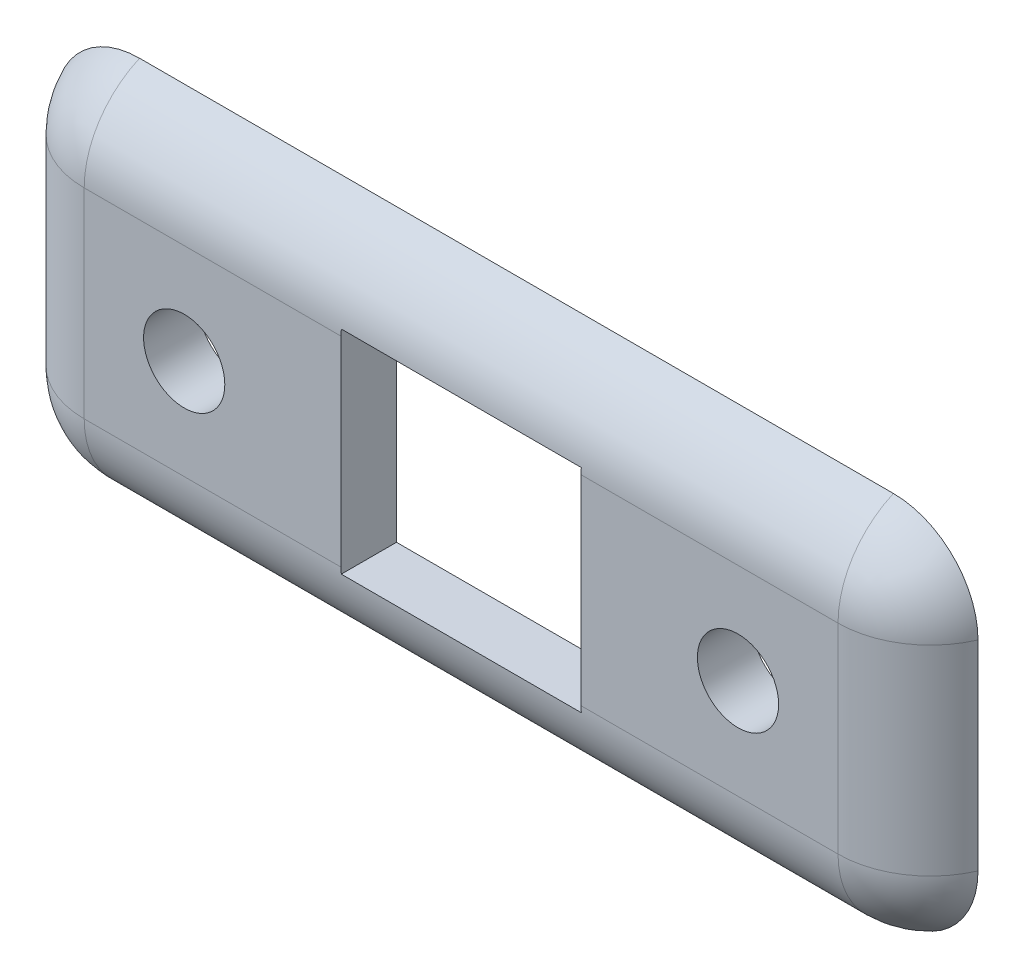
ISO-10303-21;
HEADER;
FILE_DESCRIPTION(('STEP AP214'),'2;1');
FILE_NAME('part.step','',(''),(''),'','','');
FILE_SCHEMA(('AUTOMOTIVE_DESIGN { 1 0 10303 214 1 1 1 1 }'));
ENDSEC;
DATA;
#1=APPLICATION_CONTEXT('core data for automotive mechanical design processes');
#2=APPLICATION_PROTOCOL_DEFINITION('international standard','automotive_design',2000,#1);
#3=PRODUCT_CONTEXT('',#1,'mechanical');
#4=PRODUCT('Part','Part','',(#3));
#5=PRODUCT_RELATED_PRODUCT_CATEGORY('part','',(#4));
#6=PRODUCT_DEFINITION_FORMATION('','',#4);
#7=PRODUCT_DEFINITION_CONTEXT('part definition',#1,'design');
#8=PRODUCT_DEFINITION('design','',#6,#7);
#9=PRODUCT_DEFINITION_SHAPE('','',#8);
#10=(LENGTH_UNIT() NAMED_UNIT(*) SI_UNIT(.MILLI.,.METRE.));
#11=(NAMED_UNIT(*) PLANE_ANGLE_UNIT() SI_UNIT($,.RADIAN.));
#12=(NAMED_UNIT(*) SI_UNIT($,.STERADIAN.) SOLID_ANGLE_UNIT());
#13=UNCERTAINTY_MEASURE_WITH_UNIT(LENGTH_MEASURE(1.E-05),#10,'distance_accuracy_value','');
#14=(GEOMETRIC_REPRESENTATION_CONTEXT(3) GLOBAL_UNCERTAINTY_ASSIGNED_CONTEXT((#13)) GLOBAL_UNIT_ASSIGNED_CONTEXT((#10,
#11,#12)) REPRESENTATION_CONTEXT('',''));
#15=CARTESIAN_POINT('',(0.,0.,0.));
#16=DIRECTION('',(0.,0.,1.));
#17=DIRECTION('',(1.,0.,0.));
#18=AXIS2_PLACEMENT_3D('',#15,#16,#17);
#19=CARTESIAN_POINT('',(0.,0.,3.));
#20=DIRECTION('',(0.,0.,1.));
#21=DIRECTION('',(1.,0.,0.));
#22=AXIS2_PLACEMENT_3D('',#19,#20,#21);
#23=PLANE('',#22);
#24=CARTESIAN_POINT('',(14.0422053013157,5.9351145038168,3.));
#25=DIRECTION('',(0.,0.,1.));
#26=DIRECTION('',(1.,0.,0.));
#27=AXIS2_PLACEMENT_3D('',#24,#25,#26);
#28=CIRCLE('',#27,2.2);
#29=CARTESIAN_POINT('',(16.2422053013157,5.9351145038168,3.));
#30=VERTEX_POINT('',#29);
#31=EDGE_CURVE('E153',#30,#30,#28,.T.);
#32=ORIENTED_EDGE('',*,*,#31,.F.);
#33=EDGE_LOOP('',(#32));
#34=FACE_BOUND('',#33,.T.);
#35=DIRECTION('',(0.,1.,0.));
#36=VECTOR('',#35,1.);
#37=CARTESIAN_POINT('',(5.5422053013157,11.6851145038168,3.));
#38=LINE('',#37,#36);
#39=CARTESIAN_POINT('',(5.5422053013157,0.517690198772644,3.));
#40=VERTEX_POINT('',#39);
#41=CARTESIAN_POINT('',(5.54220530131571,11.352538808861,3.));
#42=VERTEX_POINT('',#41);
#43=EDGE_CURVE('E147',#40,#42,#38,.T.);
#44=ORIENTED_EDGE('',*,*,#43,.F.);
#45=DIRECTION('',(-1.,0.,0.));
#46=VECTOR('',#45,1.);
#47=CARTESIAN_POINT('',(24.0422053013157,0.517690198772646,3.));
#48=LINE('',#47,#46);
#49=CARTESIAN_POINT('',(19.4596296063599,0.517690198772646,3.));
#50=VERTEX_POINT('',#49);
#51=EDGE_CURVE('E191',#40,#50,#48,.F.);
#52=ORIENTED_EDGE('',*,*,#51,.T.);
#53=DIRECTION('',(0.,-1.,0.));
#54=VECTOR('',#53,1.);
#55=CARTESIAN_POINT('',(19.4596296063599,15.9351145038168,3.));
#56=LINE('',#55,#54);
#57=CARTESIAN_POINT('',(19.4596296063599,11.352538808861,3.));
#58=VERTEX_POINT('',#57);
#59=EDGE_CURVE('E188',#50,#58,#56,.F.);
#60=ORIENTED_EDGE('',*,*,#59,.T.);
#61=DIRECTION('',(1.,0.,0.));
#62=VECTOR('',#61,1.);
#63=CARTESIAN_POINT('',(-25.9577946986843,11.352538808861,3.));
#64=LINE('',#63,#62);
#65=EDGE_CURVE('E186',#58,#42,#64,.F.);
#66=ORIENTED_EDGE('',*,*,#65,.T.);
#67=EDGE_LOOP('',(#44,#52,#60,#66));
#68=FACE_BOUND('',#67,.T.);
#69=ADVANCED_FACE('F33',(#34,#68),#23,.T.);
#70=CARTESIAN_POINT('',(-15.9577946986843,5.9351145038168,3.));
#71=DIRECTION('',(0.,0.,1.));
#72=DIRECTION('',(1.,0.,0.));
#73=AXIS2_PLACEMENT_3D('',#70,#71,#72);
#74=CIRCLE('',#73,2.2);
#75=CARTESIAN_POINT('',(-13.7577946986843,5.9351145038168,3.));
#76=VERTEX_POINT('',#75);
#77=EDGE_CURVE('E413',#76,#76,#74,.T.);
#78=ORIENTED_EDGE('',*,*,#77,.F.);
#79=EDGE_LOOP('',(#78));
#80=FACE_BOUND('',#79,.T.);
#81=DIRECTION('',(0.,1.,0.));
#82=VECTOR('',#81,1.);
#83=CARTESIAN_POINT('',(-21.3752190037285,-4.0648854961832,3.));
#84=LINE('',#83,#82);
#85=CARTESIAN_POINT('',(-21.3752190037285,11.352538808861,3.));
#86=VERTEX_POINT('',#85);
#87=CARTESIAN_POINT('',(-21.3752190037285,0.517690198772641,3.));
#88=VERTEX_POINT('',#87);
#89=EDGE_CURVE('E177',#86,#88,#84,.F.);
#90=ORIENTED_EDGE('',*,*,#89,.T.);
#91=DIRECTION('',(-1.,0.,0.));
#92=VECTOR('',#91,1.);
#93=CARTESIAN_POINT('',(24.0422053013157,0.517690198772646,3.));
#94=LINE('',#93,#92);
#95=CARTESIAN_POINT('',(-7.45779469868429,0.517690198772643,3.));
#96=VERTEX_POINT('',#95);
#97=EDGE_CURVE('E183',#88,#96,#94,.F.);
#98=ORIENTED_EDGE('',*,*,#97,.T.);
#99=DIRECTION('',(0.,-1.,0.));
#100=VECTOR('',#99,1.);
#101=CARTESIAN_POINT('',(-7.45779469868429,11.6851145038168,3.));
#102=LINE('',#101,#100);
#103=CARTESIAN_POINT('',(-7.45779469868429,11.352538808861,3.));
#104=VERTEX_POINT('',#103);
#105=EDGE_CURVE('E150',#104,#96,#102,.T.);
#106=ORIENTED_EDGE('',*,*,#105,.F.);
#107=DIRECTION('',(1.,0.,0.));
#108=VECTOR('',#107,1.);
#109=CARTESIAN_POINT('',(-25.9577946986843,11.352538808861,3.));
#110=LINE('',#109,#108);
#111=EDGE_CURVE('E180',#104,#86,#110,.F.);
#112=ORIENTED_EDGE('',*,*,#111,.T.);
#113=EDGE_LOOP('',(#90,#98,#106,#112));
#114=FACE_BOUND('',#113,.T.);
#115=ADVANCED_FACE('F234',(#80,#114),#23,.T.);
#116=CARTESIAN_POINT('',(0.,0.,0.));
#117=DIRECTION('',(0.,0.,1.));
#118=DIRECTION('',(1.,0.,0.));
#119=AXIS2_PLACEMENT_3D('',#116,#117,#118);
#120=PLANE('',#119);
#121=CARTESIAN_POINT('',(-15.9577946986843,5.9351145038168,0.));
#122=DIRECTION('',(0.,0.,1.));
#123=DIRECTION('',(1.,0.,0.));
#124=AXIS2_PLACEMENT_3D('',#121,#122,#123);
#125=CIRCLE('',#124,2.2);
#126=CARTESIAN_POINT('',(-13.7577946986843,5.9351145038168,0.));
#127=VERTEX_POINT('',#126);
#128=EDGE_CURVE('E158',#127,#127,#125,.T.);
#129=ORIENTED_EDGE('',*,*,#128,.T.);
#130=EDGE_LOOP('',(#129));
#131=FACE_BOUND('',#130,.T.);
#132=CARTESIAN_POINT('',(14.0422053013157,5.9351145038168,0.));
#133=DIRECTION('',(0.,0.,1.));
#134=DIRECTION('',(1.,0.,0.));
#135=AXIS2_PLACEMENT_3D('',#132,#133,#134);
#136=CIRCLE('',#135,2.2);
#137=CARTESIAN_POINT('',(16.2422053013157,5.9351145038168,0.));
#138=VERTEX_POINT('',#137);
#139=EDGE_CURVE('E411',#138,#138,#136,.T.);
#140=ORIENTED_EDGE('',*,*,#139,.T.);
#141=EDGE_LOOP('',(#140));
#142=FACE_BOUND('',#141,.T.);
#143=DIRECTION('',(-1.,0.,0.));
#144=VECTOR('',#143,1.);
#145=CARTESIAN_POINT('',(-7.45779469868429,11.6851145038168,0.));
#146=LINE('',#145,#144);
#147=CARTESIAN_POINT('',(5.5422053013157,11.6851145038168,0.));
#148=VERTEX_POINT('',#147);
#149=CARTESIAN_POINT('',(-7.45779469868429,11.6851145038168,0.));
#150=VERTEX_POINT('',#149);
#151=EDGE_CURVE('E134',#148,#150,#146,.T.);
#152=ORIENTED_EDGE('',*,*,#151,.T.);
#153=DIRECTION('',(0.,-1.,0.));
#154=VECTOR('',#153,1.);
#155=CARTESIAN_POINT('',(-7.45779469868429,11.6851145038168,0.));
#156=LINE('',#155,#154);
#157=CARTESIAN_POINT('',(-7.45779469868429,0.185114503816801,0.));
#158=VERTEX_POINT('',#157);
#159=EDGE_CURVE('E128',#150,#158,#156,.T.);
#160=ORIENTED_EDGE('',*,*,#159,.T.);
#161=DIRECTION('',(1.,0.,0.));
#162=VECTOR('',#161,1.);
#163=CARTESIAN_POINT('',(-7.45779469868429,0.185114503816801,0.));
#164=LINE('',#163,#162);
#165=CARTESIAN_POINT('',(5.5422053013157,0.185114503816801,0.));
#166=VERTEX_POINT('',#165);
#167=EDGE_CURVE('E138',#158,#166,#164,.T.);
#168=ORIENTED_EDGE('',*,*,#167,.T.);
#169=DIRECTION('',(0.,1.,0.));
#170=VECTOR('',#169,1.);
#171=CARTESIAN_POINT('',(5.5422053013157,11.6851145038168,0.));
#172=LINE('',#171,#170);
#173=EDGE_CURVE('E143',#166,#148,#172,.T.);
#174=ORIENTED_EDGE('',*,*,#173,.T.);
#175=EDGE_LOOP('',(#152,#160,#168,#174));
#176=FACE_BOUND('',#175,.T.);
#177=DIRECTION('',(0.,1.,0.));
#178=VECTOR('',#177,1.);
#179=CARTESIAN_POINT('',(24.0422053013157,-4.06488549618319,0.));
#180=LINE('',#179,#178);
#181=CARTESIAN_POINT('',(24.0422053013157,0.517690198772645,0.));
#182=VERTEX_POINT('',#181);
#183=CARTESIAN_POINT('',(24.0422053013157,11.352538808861,0.));
#184=VERTEX_POINT('',#183);
#185=EDGE_CURVE('E162',#182,#184,#180,.T.);
#186=ORIENTED_EDGE('',*,*,#185,.F.);
#187=CARTESIAN_POINT('',(19.4596296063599,0.517690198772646,0.));
#188=DIRECTION('',(0.,0.,1.));
#189=DIRECTION('',(1.,0.,0.));
#190=AXIS2_PLACEMENT_3D('',#187,#188,#189);
#191=CIRCLE('',#190,4.58257569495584);
#192=CARTESIAN_POINT('',(19.4596296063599,-4.0648854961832,0.));
#193=VERTEX_POINT('',#192);
#194=EDGE_CURVE('E221',#182,#193,#191,.F.);
#195=ORIENTED_EDGE('',*,*,#194,.T.);
#196=DIRECTION('',(1.,0.,0.));
#197=VECTOR('',#196,1.);
#198=CARTESIAN_POINT('',(24.0422053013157,-4.06488549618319,0.));
#199=LINE('',#198,#197);
#200=CARTESIAN_POINT('',(-21.3752190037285,-4.0648854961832,0.));
#201=VERTEX_POINT('',#200);
#202=EDGE_CURVE('E174',#201,#193,#199,.T.);
#203=ORIENTED_EDGE('',*,*,#202,.F.);
#204=CARTESIAN_POINT('',(-21.3752190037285,0.517690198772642,0.));
#205=DIRECTION('',(0.,0.,1.));
#206=DIRECTION('',(1.,0.,0.));
#207=AXIS2_PLACEMENT_3D('',#204,#205,#206);
#208=CIRCLE('',#207,4.58257569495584);
#209=CARTESIAN_POINT('',(-25.9577946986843,0.517690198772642,0.));
#210=VERTEX_POINT('',#209);
#211=EDGE_CURVE('E216',#201,#210,#208,.F.);
#212=ORIENTED_EDGE('',*,*,#211,.T.);
#213=DIRECTION('',(0.,-1.,0.));
#214=VECTOR('',#213,1.);
#215=CARTESIAN_POINT('',(-25.9577946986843,-4.0648854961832,0.));
#216=LINE('',#215,#214);
#217=CARTESIAN_POINT('',(-25.9577946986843,11.352538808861,0.));
#218=VERTEX_POINT('',#217);
#219=EDGE_CURVE('E171',#218,#210,#216,.T.);
#220=ORIENTED_EDGE('',*,*,#219,.F.);
#221=CARTESIAN_POINT('',(-21.3752190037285,11.352538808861,0.));
#222=DIRECTION('',(0.,0.,1.));
#223=DIRECTION('',(1.,0.,0.));
#224=AXIS2_PLACEMENT_3D('',#221,#222,#223);
#225=CIRCLE('',#224,4.58257569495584);
#226=CARTESIAN_POINT('',(-21.3752190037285,15.9351145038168,0.));
#227=VERTEX_POINT('',#226);
#228=EDGE_CURVE('E48',#218,#227,#225,.F.);
#229=ORIENTED_EDGE('',*,*,#228,.T.);
#230=DIRECTION('',(-1.,0.,0.));
#231=VECTOR('',#230,1.);
#232=CARTESIAN_POINT('',(24.0422053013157,15.9351145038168,0.));
#233=LINE('',#232,#231);
#234=CARTESIAN_POINT('',(19.4596296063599,15.9351145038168,0.));
#235=VERTEX_POINT('',#234);
#236=EDGE_CURVE('E169',#235,#227,#233,.T.);
#237=ORIENTED_EDGE('',*,*,#236,.F.);
#238=CARTESIAN_POINT('',(19.4596296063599,11.352538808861,0.));
#239=DIRECTION('',(0.,0.,1.));
#240=DIRECTION('',(1.,0.,0.));
#241=AXIS2_PLACEMENT_3D('',#238,#239,#240);
#242=CIRCLE('',#241,4.58257569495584);
#243=EDGE_CURVE('E219',#235,#184,#242,.F.);
#244=ORIENTED_EDGE('',*,*,#243,.T.);
#245=EDGE_LOOP('',(#186,#195,#203,#212,#220,#229,#237,#244));
#246=FACE_BOUND('',#245,.T.);
#247=ADVANCED_FACE('F145',(#131,#142,#176,#246),#120,.F.);
#248=CARTESIAN_POINT('',(-7.45779469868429,11.6851145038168,0.));
#249=DIRECTION('',(-1.,0.,0.));
#250=DIRECTION('',(0.,0.,1.));
#251=AXIS2_PLACEMENT_3D('',#248,#249,#250);
#252=PLANE('',#251);
#253=ORIENTED_EDGE('',*,*,#105,.T.);
#254=CARTESIAN_POINT('',(-7.45779469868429,0.517690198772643,-2.));
#255=DIRECTION('',(-1.,0.,0.));
#256=DIRECTION('',(0.,0.,1.));
#257=AXIS2_PLACEMENT_3D('',#254,#255,#256);
#258=CIRCLE('',#257,5.);
#259=CARTESIAN_POINT('',(-7.45779469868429,0.185114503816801,2.98892707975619));
#260=VERTEX_POINT('',#259);
#261=EDGE_CURVE('E130',#96,#260,#258,.F.);
#262=ORIENTED_EDGE('',*,*,#261,.T.);
#263=DIRECTION('',(0.,0.,1.));
#264=VECTOR('',#263,1.);
#265=CARTESIAN_POINT('',(-7.45779469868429,0.185114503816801,0.));
#266=LINE('',#265,#264);
#267=EDGE_CURVE('E122',#158,#260,#266,.T.);
#268=ORIENTED_EDGE('',*,*,#267,.F.);
#269=ORIENTED_EDGE('',*,*,#159,.F.);
#270=DIRECTION('',(0.,0.,1.));
#271=VECTOR('',#270,1.);
#272=CARTESIAN_POINT('',(-7.45779469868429,11.6851145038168,0.));
#273=LINE('',#272,#271);
#274=CARTESIAN_POINT('',(-7.45779469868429,11.6851145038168,2.98892707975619));
#275=VERTEX_POINT('',#274);
#276=EDGE_CURVE('E160',#150,#275,#273,.T.);
#277=ORIENTED_EDGE('',*,*,#276,.T.);
#278=CARTESIAN_POINT('',(-7.45779469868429,11.352538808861,-2.));
#279=DIRECTION('',(-1.,0.,0.));
#280=DIRECTION('',(0.,0.,1.));
#281=AXIS2_PLACEMENT_3D('',#278,#279,#280);
#282=CIRCLE('',#281,5.);
#283=EDGE_CURVE('E194',#275,#104,#282,.F.);
#284=ORIENTED_EDGE('',*,*,#283,.T.);
#285=EDGE_LOOP('',(#253,#262,#268,#269,#277,#284));
#286=FACE_BOUND('',#285,.T.);
#287=ADVANCED_FACE('F125',(#286),#252,.F.);
#288=CARTESIAN_POINT('',(-7.45779469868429,11.6851145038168,0.));
#289=DIRECTION('',(0.,1.,0.));
#290=DIRECTION('',(0.,0.,1.));
#291=AXIS2_PLACEMENT_3D('',#288,#289,#290);
#292=PLANE('',#291);
#293=DIRECTION('',(0.,0.,1.));
#294=VECTOR('',#293,1.);
#295=CARTESIAN_POINT('',(5.5422053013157,11.6851145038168,0.));
#296=LINE('',#295,#294);
#297=CARTESIAN_POINT('',(5.5422053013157,11.6851145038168,2.98892707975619));
#298=VERTEX_POINT('',#297);
#299=EDGE_CURVE('E163',#148,#298,#296,.T.);
#300=ORIENTED_EDGE('',*,*,#299,.T.);
#301=DIRECTION('',(-1.,0.,0.));
#302=VECTOR('',#301,1.);
#303=CARTESIAN_POINT('',(5.5422053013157,11.6851145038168,2.98892707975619));
#304=LINE('',#303,#302);
#305=EDGE_CURVE('E203',#298,#275,#304,.T.);
#306=ORIENTED_EDGE('',*,*,#305,.T.);
#307=ORIENTED_EDGE('',*,*,#276,.F.);
#308=ORIENTED_EDGE('',*,*,#151,.F.);
#309=EDGE_LOOP('',(#300,#306,#307,#308));
#310=FACE_BOUND('',#309,.T.);
#311=ADVANCED_FACE('F262',(#310),#292,.F.);
#312=CARTESIAN_POINT('',(5.5422053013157,11.6851145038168,0.));
#313=DIRECTION('',(1.,0.,0.));
#314=DIRECTION('',(0.,0.,-1.));
#315=AXIS2_PLACEMENT_3D('',#312,#313,#314);
#316=PLANE('',#315);
#317=DIRECTION('',(0.,0.,1.));
#318=VECTOR('',#317,1.);
#319=CARTESIAN_POINT('',(5.5422053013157,0.185114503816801,0.));
#320=LINE('',#319,#318);
#321=CARTESIAN_POINT('',(5.54220530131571,0.185114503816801,2.98892707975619));
#322=VERTEX_POINT('',#321);
#323=EDGE_CURVE('E133',#166,#322,#320,.T.);
#324=ORIENTED_EDGE('',*,*,#323,.T.);
#325=CARTESIAN_POINT('',(5.54220530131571,0.517690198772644,-2.));
#326=DIRECTION('',(1.,0.,0.));
#327=DIRECTION('',(0.,0.,-1.));
#328=AXIS2_PLACEMENT_3D('',#325,#326,#327);
#329=CIRCLE('',#328,5.);
#330=EDGE_CURVE('E201',#322,#40,#329,.F.);
#331=ORIENTED_EDGE('',*,*,#330,.T.);
#332=ORIENTED_EDGE('',*,*,#43,.T.);
#333=CARTESIAN_POINT('',(5.54220530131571,11.352538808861,-2.));
#334=DIRECTION('',(1.,0.,0.));
#335=DIRECTION('',(0.,0.,-1.));
#336=AXIS2_PLACEMENT_3D('',#333,#334,#335);
#337=CIRCLE('',#336,5.);
#338=EDGE_CURVE('E199',#42,#298,#337,.F.);
#339=ORIENTED_EDGE('',*,*,#338,.T.);
#340=ORIENTED_EDGE('',*,*,#299,.F.);
#341=ORIENTED_EDGE('',*,*,#173,.F.);
#342=EDGE_LOOP('',(#324,#331,#332,#339,#340,#341));
#343=FACE_BOUND('',#342,.T.);
#344=ADVANCED_FACE('F260',(#343),#316,.F.);
#345=CARTESIAN_POINT('',(-7.45779469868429,0.185114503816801,0.));
#346=DIRECTION('',(0.,-1.,0.));
#347=DIRECTION('',(0.,0.,-1.));
#348=AXIS2_PLACEMENT_3D('',#345,#346,#347);
#349=PLANE('',#348);
#350=ORIENTED_EDGE('',*,*,#267,.T.);
#351=DIRECTION('',(1.,0.,0.));
#352=VECTOR('',#351,1.);
#353=CARTESIAN_POINT('',(-7.45779469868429,0.185114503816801,2.98892707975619));
#354=LINE('',#353,#352);
#355=EDGE_CURVE('E197',#260,#322,#354,.T.);
#356=ORIENTED_EDGE('',*,*,#355,.T.);
#357=ORIENTED_EDGE('',*,*,#323,.F.);
#358=ORIENTED_EDGE('',*,*,#167,.F.);
#359=EDGE_LOOP('',(#350,#356,#357,#358));
#360=FACE_BOUND('',#359,.T.);
#361=ADVANCED_FACE('F139',(#360),#349,.F.);
#362=CARTESIAN_POINT('',(14.0422053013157,5.9351145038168,0.));
#363=DIRECTION('',(0.,0.,1.));
#364=DIRECTION('',(1.,0.,0.));
#365=AXIS2_PLACEMENT_3D('',#362,#363,#364);
#366=CYLINDRICAL_SURFACE('',#365,2.2);
#367=ORIENTED_EDGE('',*,*,#139,.F.);
#368=EDGE_LOOP('',(#367));
#369=FACE_BOUND('',#368,.T.);
#370=ORIENTED_EDGE('',*,*,#31,.T.);
#371=EDGE_LOOP('',(#370));
#372=FACE_BOUND('',#371,.T.);
#373=ADVANCED_FACE('F353',(#369,#372),#366,.F.);
#374=CARTESIAN_POINT('',(-15.9577946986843,5.9351145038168,0.));
#375=DIRECTION('',(0.,0.,1.));
#376=DIRECTION('',(1.,0.,0.));
#377=AXIS2_PLACEMENT_3D('',#374,#375,#376);
#378=CYLINDRICAL_SURFACE('',#377,2.2);
#379=ORIENTED_EDGE('',*,*,#128,.F.);
#380=EDGE_LOOP('',(#379));
#381=FACE_BOUND('',#380,.T.);
#382=ORIENTED_EDGE('',*,*,#77,.T.);
#383=EDGE_LOOP('',(#382));
#384=FACE_BOUND('',#383,.T.);
#385=ADVANCED_FACE('F295',(#381,#384),#378,.F.);
#386=CARTESIAN_POINT('',(24.0422053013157,11.352538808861,-2.));
#387=DIRECTION('',(-1.,0.,0.));
#388=DIRECTION('',(0.,0.,1.));
#389=AXIS2_PLACEMENT_3D('',#386,#387,#388);
#390=CYLINDRICAL_SURFACE('',#389,5.);
#391=ORIENTED_EDGE('',*,*,#65,.F.);
#392=CARTESIAN_POINT('',(19.4596296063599,11.352538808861,-2.));
#393=DIRECTION('',(-1.,0.,0.));
#394=DIRECTION('',(0.,0.,1.));
#395=AXIS2_PLACEMENT_3D('',#392,#393,#394);
#396=CIRCLE('',#395,5.);
#397=EDGE_CURVE('E55',#58,#235,#396,.T.);
#398=ORIENTED_EDGE('',*,*,#397,.T.);
#399=ORIENTED_EDGE('',*,*,#236,.T.);
#400=CARTESIAN_POINT('',(-21.3752190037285,11.352538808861,-2.));
#401=DIRECTION('',(-1.,0.,0.));
#402=DIRECTION('',(0.,0.,1.));
#403=AXIS2_PLACEMENT_3D('',#400,#401,#402);
#404=CIRCLE('',#403,5.);
#405=EDGE_CURVE('E223',#227,#86,#404,.F.);
#406=ORIENTED_EDGE('',*,*,#405,.T.);
#407=ORIENTED_EDGE('',*,*,#111,.F.);
#408=ORIENTED_EDGE('',*,*,#283,.F.);
#409=ORIENTED_EDGE('',*,*,#305,.F.);
#410=ORIENTED_EDGE('',*,*,#338,.F.);
#411=EDGE_LOOP('',(#391,#398,#399,#406,#407,#408,#409,#410));
#412=FACE_BOUND('',#411,.T.);
#413=ADVANCED_FACE('F256',(#412),#390,.T.);
#414=CARTESIAN_POINT('',(-21.3752190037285,-4.0648854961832,-2.));
#415=DIRECTION('',(0.,-1.,0.));
#416=DIRECTION('',(0.,0.,-1.));
#417=AXIS2_PLACEMENT_3D('',#414,#415,#416);
#418=CYLINDRICAL_SURFACE('',#417,5.);
#419=ORIENTED_EDGE('',*,*,#89,.F.);
#420=CARTESIAN_POINT('',(-21.3752190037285,11.352538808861,-2.));
#421=DIRECTION('',(0.,-1.,0.));
#422=DIRECTION('',(0.,0.,-1.));
#423=AXIS2_PLACEMENT_3D('',#420,#421,#422);
#424=CIRCLE('',#423,5.);
#425=EDGE_CURVE('E11',#86,#218,#424,.T.);
#426=ORIENTED_EDGE('',*,*,#425,.T.);
#427=ORIENTED_EDGE('',*,*,#219,.T.);
#428=CARTESIAN_POINT('',(-21.3752190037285,0.517690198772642,-2.));
#429=DIRECTION('',(0.,-1.,0.));
#430=DIRECTION('',(0.,0.,-1.));
#431=AXIS2_PLACEMENT_3D('',#428,#429,#430);
#432=CIRCLE('',#431,5.);
#433=EDGE_CURVE('E41',#210,#88,#432,.F.);
#434=ORIENTED_EDGE('',*,*,#433,.T.);
#435=EDGE_LOOP('',(#419,#426,#427,#434));
#436=FACE_BOUND('',#435,.T.);
#437=ADVANCED_FACE('F228',(#436),#418,.T.);
#438=CARTESIAN_POINT('',(19.4596296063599,-4.06488549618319,-2.));
#439=DIRECTION('',(0.,1.,0.));
#440=DIRECTION('',(0.,0.,1.));
#441=AXIS2_PLACEMENT_3D('',#438,#439,#440);
#442=CYLINDRICAL_SURFACE('',#441,5.);
#443=ORIENTED_EDGE('',*,*,#59,.F.);
#444=CARTESIAN_POINT('',(19.4596296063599,0.517690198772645,-2.));
#445=DIRECTION('',(0.,1.,0.));
#446=DIRECTION('',(0.,0.,1.));
#447=AXIS2_PLACEMENT_3D('',#444,#445,#446);
#448=CIRCLE('',#447,5.);
#449=EDGE_CURVE('E214',#50,#182,#448,.T.);
#450=ORIENTED_EDGE('',*,*,#449,.T.);
#451=ORIENTED_EDGE('',*,*,#185,.T.);
#452=CARTESIAN_POINT('',(19.4596296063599,11.352538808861,-2.));
#453=DIRECTION('',(0.,1.,0.));
#454=DIRECTION('',(0.,0.,1.));
#455=AXIS2_PLACEMENT_3D('',#452,#453,#454);
#456=CIRCLE('',#455,5.);
#457=EDGE_CURVE('E211',#184,#58,#456,.F.);
#458=ORIENTED_EDGE('',*,*,#457,.T.);
#459=EDGE_LOOP('',(#443,#450,#451,#458));
#460=FACE_BOUND('',#459,.T.);
#461=ADVANCED_FACE('F248',(#460),#442,.T.);
#462=CARTESIAN_POINT('',(24.0422053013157,0.517690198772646,-2.));
#463=DIRECTION('',(1.,0.,0.));
#464=DIRECTION('',(0.,1.,0.));
#465=AXIS2_PLACEMENT_3D('',#462,#463,#464);
#466=CYLINDRICAL_SURFACE('',#465,5.);
#467=ORIENTED_EDGE('',*,*,#202,.T.);
#468=CARTESIAN_POINT('',(19.4596296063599,0.517690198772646,-2.));
#469=DIRECTION('',(1.,0.,0.));
#470=DIRECTION('',(0.,1.,0.));
#471=AXIS2_PLACEMENT_3D('',#468,#469,#470);
#472=CIRCLE('',#471,5.);
#473=EDGE_CURVE('E208',#193,#50,#472,.F.);
#474=ORIENTED_EDGE('',*,*,#473,.T.);
#475=ORIENTED_EDGE('',*,*,#51,.F.);
#476=ORIENTED_EDGE('',*,*,#330,.F.);
#477=ORIENTED_EDGE('',*,*,#355,.F.);
#478=ORIENTED_EDGE('',*,*,#261,.F.);
#479=ORIENTED_EDGE('',*,*,#97,.F.);
#480=CARTESIAN_POINT('',(-21.3752190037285,0.517690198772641,-2.));
#481=DIRECTION('',(1.,0.,0.));
#482=DIRECTION('',(0.,1.,0.));
#483=AXIS2_PLACEMENT_3D('',#480,#481,#482);
#484=CIRCLE('',#483,5.);
#485=EDGE_CURVE('E205',#88,#201,#484,.T.);
#486=ORIENTED_EDGE('',*,*,#485,.T.);
#487=EDGE_LOOP('',(#467,#474,#475,#476,#477,#478,#479,#486));
#488=FACE_BOUND('',#487,.T.);
#489=ADVANCED_FACE('F238',(#488),#466,.T.);
#490=CARTESIAN_POINT('',(19.4596296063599,0.517690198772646,-2.));
#491=DIRECTION('',(0.,0.,1.));
#492=DIRECTION('',(1.,0.,0.));
#493=AXIS2_PLACEMENT_3D('',#490,#491,#492);
#494=SPHERICAL_SURFACE('',#493,5.);
#495=ORIENTED_EDGE('',*,*,#194,.F.);
#496=ORIENTED_EDGE('',*,*,#449,.F.);
#497=ORIENTED_EDGE('',*,*,#473,.F.);
#498=EDGE_LOOP('',(#495,#496,#497));
#499=FACE_BOUND('',#498,.T.);
#500=ADVANCED_FACE('F245',(#499),#494,.T.);
#501=CARTESIAN_POINT('',(19.4596296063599,11.352538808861,-2.));
#502=DIRECTION('',(0.,0.,1.));
#503=DIRECTION('',(1.,0.,0.));
#504=AXIS2_PLACEMENT_3D('',#501,#502,#503);
#505=SPHERICAL_SURFACE('',#504,5.);
#506=ORIENTED_EDGE('',*,*,#243,.F.);
#507=ORIENTED_EDGE('',*,*,#397,.F.);
#508=ORIENTED_EDGE('',*,*,#457,.F.);
#509=EDGE_LOOP('',(#506,#507,#508));
#510=FACE_BOUND('',#509,.T.);
#511=ADVANCED_FACE('F252',(#510),#505,.T.);
#512=CARTESIAN_POINT('',(-21.3752190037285,11.352538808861,-2.));
#513=DIRECTION('',(0.,0.,1.));
#514=DIRECTION('',(1.,0.,0.));
#515=AXIS2_PLACEMENT_3D('',#512,#513,#514);
#516=SPHERICAL_SURFACE('',#515,5.);
#517=ORIENTED_EDGE('',*,*,#425,.F.);
#518=ORIENTED_EDGE('',*,*,#405,.F.);
#519=ORIENTED_EDGE('',*,*,#228,.F.);
#520=EDGE_LOOP('',(#517,#518,#519));
#521=FACE_BOUND('',#520,.T.);
#522=ADVANCED_FACE('F266',(#521),#516,.T.);
#523=CARTESIAN_POINT('',(-21.3752190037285,0.517690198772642,-2.));
#524=DIRECTION('',(0.,0.,1.));
#525=DIRECTION('',(1.,0.,0.));
#526=AXIS2_PLACEMENT_3D('',#523,#524,#525);
#527=SPHERICAL_SURFACE('',#526,5.);
#528=ORIENTED_EDGE('',*,*,#485,.F.);
#529=ORIENTED_EDGE('',*,*,#433,.F.);
#530=ORIENTED_EDGE('',*,*,#211,.F.);
#531=EDGE_LOOP('',(#528,#529,#530));
#532=FACE_BOUND('',#531,.T.);
#533=ADVANCED_FACE('F35',(#532),#527,.T.);
#534=CLOSED_SHELL('',(#69,#115,#247,#287,#311,#344,#361,#373,#385,#413,#437,#461,#489,#500,#511,
#522,#533));
#535=MANIFOLD_SOLID_BREP('B2',#534);
#536=ADVANCED_BREP_SHAPE_REPRESENTATION('',(#18,#535),#14);
#537=SHAPE_DEFINITION_REPRESENTATION(#9,#536);
ENDSEC;
END-ISO-10303-21;
